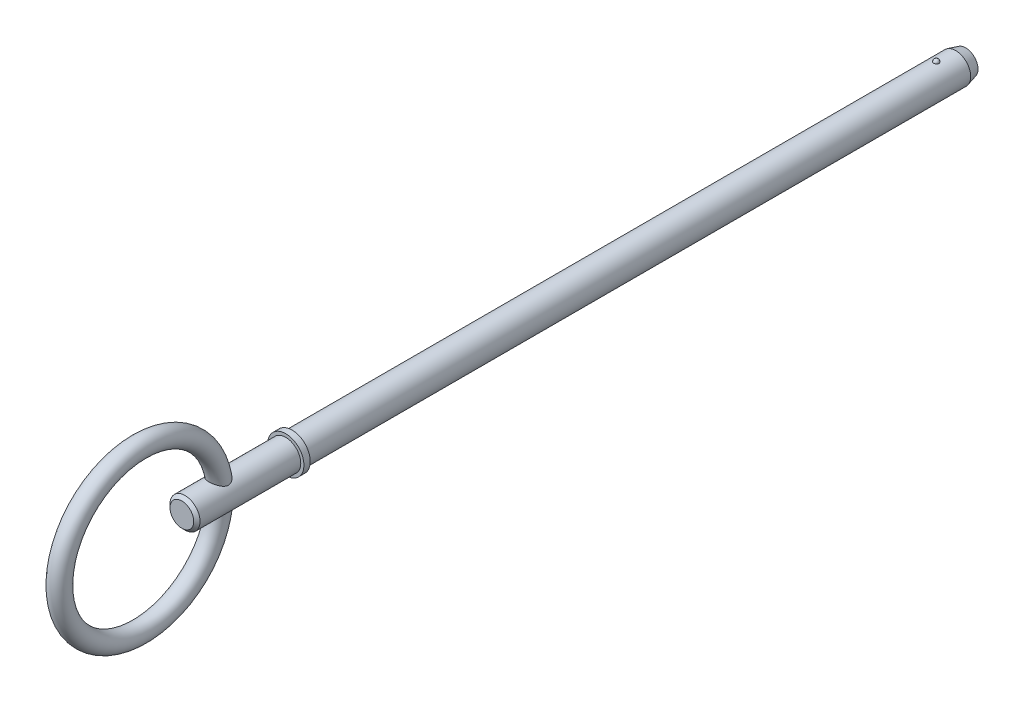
from build123d import *

# Parameters (mm, degrees)
SKETCH2_R           = 2.38
BOSS_EXTRUDE1_DEPTH = 101.6
BOSS_EXTRUDE2_START = 5.08
SKETCH3_R           = 2.38
BOSS_EXTRUDE2_DEPTH = 5.08
CHAMFER1_SIZE       = 1.586
CHAMFER1_SIZE2      = 0.424967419
SKETCH20_W          = 1
SKETCH20_H          = 2.88
SKETCH21_R          = 2.38
BOSS_EXTRUDE3_DEPTH = 17.45
CHAMFER2_SIZE       = 0.5
SKETCH24_R          = 1.5


with BuildPart() as part:
    # Sketch2 → Boss-Extrude1 (new body)
    with BuildSketch(Plane.XY):
        Circle(SKETCH2_R)
    extrude(amount=BOSS_EXTRUDE1_DEPTH)

    # Sketch3 → Boss-Extrude2 (add)
    with BuildSketch(Plane(origin=(0, 0, 0), x_dir=(-1, 0, 0), z_dir=(0, 0, -1)).offset(BOSS_EXTRUDE2_START)):
        Circle(SKETCH3_R)
    extrude(amount=-BOSS_EXTRUDE2_DEPTH)

    # Chamfer1
    chamfer1_edges = [part.edges().sort_by_distance(p)[0] for p in [
        (2.38, 0, -5.08),
    ]]
    chamfer1_side = [part.faces().sort_by_distance(p)[0] for p in [
        (2.38, 0, -2.54),
    ]]
    chamfer(chamfer1_edges, length=CHAMFER1_SIZE, length2=CHAMFER1_SIZE2, reference=chamfer1_side[0])

    # Sketch18 → Revolve1 (revolve)
    with BuildSketch(Plane(origin=(0, 0, 0), x_dir=(0, 0, -1), z_dir=(1, 0, 0))):
        with BuildLine():
            Line((0.42, 2.8), (0.42, 1.96))
            ThreePointArc((0.42, 1.96), (0, 2.38), (0.42, 2.8))
        make_face()
    revolve(axis=Axis((0, 2.8, -0.42), (0, -1, 0)))

    # Sketch20 → Revolve2 (revolve)
    with BuildSketch(Plane(origin=(0, 0, 0), x_dir=(0, 0, -1), z_dir=(1, 0, 0)), mode=Mode.PRIVATE) as revolve2_sk:
        with Locations((-102.1, 1.44)):
            Rectangle(SKETCH20_W, SKETCH20_H)
    revolve(revolve2_sk.sketch.rotate(Axis((0, 0, 33.728787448), (0, 0, 1)), 90), axis=Axis((0, 0, 33.728787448), (0, 0, 1)))

    # Sketch21 → Boss-Extrude3 (add)
    with BuildSketch(Plane(origin=(0, 0, 101.6), x_dir=(-1, 0, 0), z_dir=(0, 0, -1))):
        Circle(SKETCH21_R)
    extrude(amount=-BOSS_EXTRUDE3_DEPTH)

    # Chamfer2
    chamfer2_edges = [part.edges().sort_by_distance(p)[0] for p in [
        (2.38, 0, 119.05),
    ]]
    chamfer(chamfer2_edges, length=CHAMFER2_SIZE)

    # Sweep1: sweep along a path in Sketch23
    with BuildLine(Plane(origin=(0, 0, 0), x_dir=(0, 0, -1), z_dir=(1, 0, 0))) as sweep1_path:
        CenterArc((-125.75, 0), 12.7, 0, 360)
    # Sketch24 → Sweep1 (sweep)
    with BuildSketch(Plane(origin=(0, 0, 0), x_dir=(1, 0, 0), z_dir=(0, 1, 0))):
        with Locations((0, -113.05)):
            Circle(SKETCH24_R)
    sweep(path=sweep1_path.line)


solid = part.part
